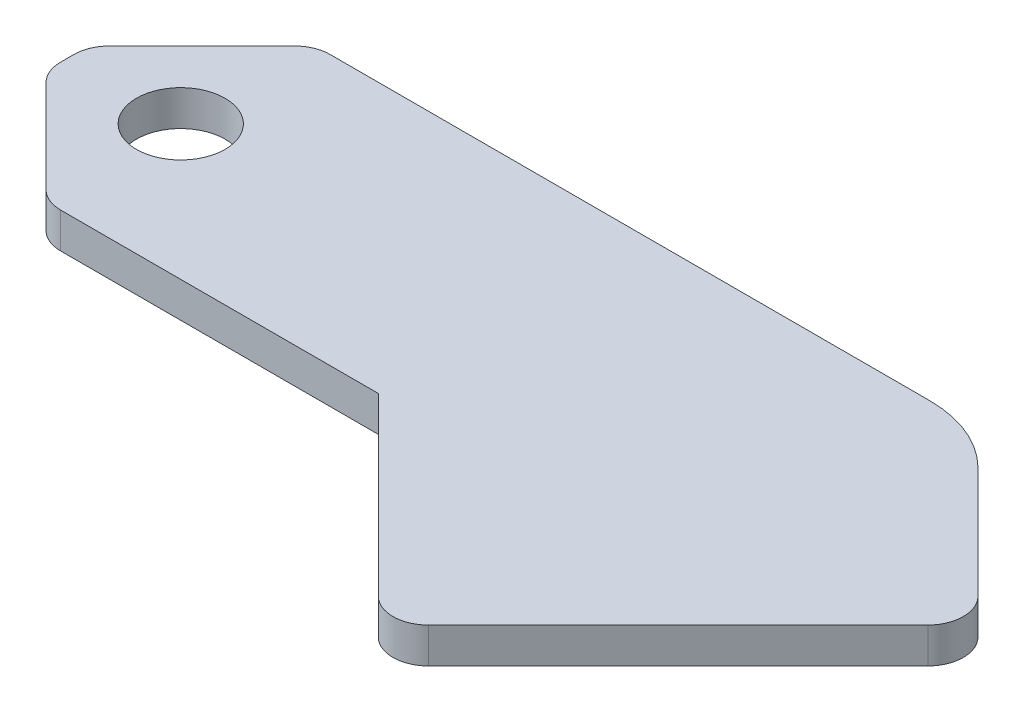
ISO-10303-21;
HEADER;
FILE_DESCRIPTION(('STEP AP214'),'2;1');
FILE_NAME('part.step','',(''),(''),'','','');
FILE_SCHEMA(('AUTOMOTIVE_DESIGN { 1 0 10303 214 1 1 1 1 }'));
ENDSEC;
DATA;
#1=APPLICATION_CONTEXT('core data for automotive mechanical design processes');
#2=APPLICATION_PROTOCOL_DEFINITION('international standard','automotive_design',2000,#1);
#3=PRODUCT_CONTEXT('',#1,'mechanical');
#4=PRODUCT('Part','Part','',(#3));
#5=PRODUCT_RELATED_PRODUCT_CATEGORY('part','',(#4));
#6=PRODUCT_DEFINITION_FORMATION('','',#4);
#7=PRODUCT_DEFINITION_CONTEXT('part definition',#1,'design');
#8=PRODUCT_DEFINITION('design','',#6,#7);
#9=PRODUCT_DEFINITION_SHAPE('','',#8);
#10=(LENGTH_UNIT() NAMED_UNIT(*) SI_UNIT(.MILLI.,.METRE.));
#11=(NAMED_UNIT(*) PLANE_ANGLE_UNIT() SI_UNIT($,.RADIAN.));
#12=(NAMED_UNIT(*) SI_UNIT($,.STERADIAN.) SOLID_ANGLE_UNIT());
#13=UNCERTAINTY_MEASURE_WITH_UNIT(LENGTH_MEASURE(1.E-05),#10,'distance_accuracy_value','');
#14=(GEOMETRIC_REPRESENTATION_CONTEXT(3) GLOBAL_UNCERTAINTY_ASSIGNED_CONTEXT((#13)) GLOBAL_UNIT_ASSIGNED_CONTEXT((#10,
#11,#12)) REPRESENTATION_CONTEXT('',''));
#15=CARTESIAN_POINT('',(0.,0.,0.));
#16=DIRECTION('',(0.,0.,1.));
#17=DIRECTION('',(1.,0.,0.));
#18=AXIS2_PLACEMENT_3D('',#15,#16,#17);
#19=CARTESIAN_POINT('',(-11.,-2.5,0.9289321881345));
#20=DIRECTION('',(0.,1.,0.));
#21=DIRECTION('',(0.,0.,1.));
#22=AXIS2_PLACEMENT_3D('',#19,#20,#21);
#23=CYLINDRICAL_SURFACE('',#22,5.00000000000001);
#24=CARTESIAN_POINT('',(-11.,2.5,0.9289321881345));
#25=DIRECTION('',(0.,1.,0.));
#26=DIRECTION('',(0.,0.,1.));
#27=AXIS2_PLACEMENT_3D('',#24,#25,#26);
#28=CIRCLE('',#27,5.00000000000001);
#29=CARTESIAN_POINT('',(-16.,2.5,0.9289321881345));
#30=VERTEX_POINT('',#29);
#31=CARTESIAN_POINT('',(-14.5355339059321,2.5,4.46446609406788));
#32=VERTEX_POINT('',#31);
#33=EDGE_CURVE('E174',#30,#32,#28,.T.);
#34=ORIENTED_EDGE('',*,*,#33,.F.);
#35=DIRECTION('',(0.,1.,0.));
#36=VECTOR('',#35,1.);
#37=CARTESIAN_POINT('',(-16.,-2.5,0.9289321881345));
#38=LINE('',#37,#36);
#39=CARTESIAN_POINT('',(-16.,-2.5,0.9289321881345));
#40=VERTEX_POINT('',#39);
#41=EDGE_CURVE('E11',#40,#30,#38,.T.);
#42=ORIENTED_EDGE('',*,*,#41,.F.);
#43=CARTESIAN_POINT('',(-11.,-2.5,0.9289321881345));
#44=DIRECTION('',(0.,1.,0.));
#45=DIRECTION('',(0.,0.,1.));
#46=AXIS2_PLACEMENT_3D('',#43,#44,#45);
#47=CIRCLE('',#46,5.00000000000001);
#48=CARTESIAN_POINT('',(-14.5355339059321,-2.5,4.46446609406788));
#49=VERTEX_POINT('',#48);
#50=EDGE_CURVE('E216',#40,#49,#47,.T.);
#51=ORIENTED_EDGE('',*,*,#50,.T.);
#52=DIRECTION('',(0.,1.,0.));
#53=VECTOR('',#52,1.);
#54=CARTESIAN_POINT('',(-14.5355339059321,-2.5,4.46446609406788));
#55=LINE('',#54,#53);
#56=EDGE_CURVE('E38',#49,#32,#55,.T.);
#57=ORIENTED_EDGE('',*,*,#56,.T.);
#58=EDGE_LOOP('',(#34,#42,#51,#57));
#59=FACE_BOUND('',#58,.T.);
#60=ADVANCED_FACE('F35',(#59),#23,.T.);
#61=CARTESIAN_POINT('',(-16.,-2.5,-0.9289321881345));
#62=DIRECTION('',(-1.,0.,0.));
#63=DIRECTION('',(0.,0.,1.));
#64=AXIS2_PLACEMENT_3D('',#61,#62,#63);
#65=PLANE('',#64);
#66=DIRECTION('',(0.,0.,1.));
#67=VECTOR('',#66,1.);
#68=CARTESIAN_POINT('',(-16.,2.5,-0.9289321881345));
#69=LINE('',#68,#67);
#70=CARTESIAN_POINT('',(-16.,2.5,-0.928932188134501));
#71=VERTEX_POINT('',#70);
#72=EDGE_CURVE('E214',#71,#30,#69,.T.);
#73=ORIENTED_EDGE('',*,*,#72,.F.);
#74=DIRECTION('',(0.,1.,0.));
#75=VECTOR('',#74,1.);
#76=CARTESIAN_POINT('',(-16.,-2.5,-0.928932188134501));
#77=LINE('',#76,#75);
#78=CARTESIAN_POINT('',(-16.,-2.5,-0.928932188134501));
#79=VERTEX_POINT('',#78);
#80=EDGE_CURVE('E44',#79,#71,#77,.T.);
#81=ORIENTED_EDGE('',*,*,#80,.F.);
#82=DIRECTION('',(0.,0.,1.));
#83=VECTOR('',#82,1.);
#84=CARTESIAN_POINT('',(-16.,-2.5,-0.9289321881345));
#85=LINE('',#84,#83);
#86=EDGE_CURVE('E164',#79,#40,#85,.T.);
#87=ORIENTED_EDGE('',*,*,#86,.T.);
#88=ORIENTED_EDGE('',*,*,#41,.T.);
#89=EDGE_LOOP('',(#73,#81,#87,#88));
#90=FACE_BOUND('',#89,.T.);
#91=ADVANCED_FACE('F242',(#90),#65,.T.);
#92=CARTESIAN_POINT('',(-11.,-2.5,-0.9289321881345));
#93=DIRECTION('',(0.,1.,0.));
#94=DIRECTION('',(0.,0.,1.));
#95=AXIS2_PLACEMENT_3D('',#92,#93,#94);
#96=CYLINDRICAL_SURFACE('',#95,5.00000000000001);
#97=CARTESIAN_POINT('',(-11.,2.5,-0.9289321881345));
#98=DIRECTION('',(0.,1.,0.));
#99=DIRECTION('',(0.,0.,1.));
#100=AXIS2_PLACEMENT_3D('',#97,#98,#99);
#101=CIRCLE('',#100,5.00000000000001);
#102=CARTESIAN_POINT('',(-14.5355339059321,2.5,-4.46446609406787));
#103=VERTEX_POINT('',#102);
#104=EDGE_CURVE('E151',#103,#71,#101,.T.);
#105=ORIENTED_EDGE('',*,*,#104,.F.);
#106=DIRECTION('',(0.,1.,0.));
#107=VECTOR('',#106,1.);
#108=CARTESIAN_POINT('',(-14.5355339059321,-2.5,-4.46446609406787));
#109=LINE('',#108,#107);
#110=CARTESIAN_POINT('',(-14.5355339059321,-2.5,-4.46446609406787));
#111=VERTEX_POINT('',#110);
#112=EDGE_CURVE('E146',#111,#103,#109,.T.);
#113=ORIENTED_EDGE('',*,*,#112,.F.);
#114=CARTESIAN_POINT('',(-11.,-2.5,-0.9289321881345));
#115=DIRECTION('',(0.,1.,0.));
#116=DIRECTION('',(0.,0.,1.));
#117=AXIS2_PLACEMENT_3D('',#114,#115,#116);
#118=CIRCLE('',#117,5.00000000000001);
#119=EDGE_CURVE('E149',#111,#79,#118,.T.);
#120=ORIENTED_EDGE('',*,*,#119,.T.);
#121=ORIENTED_EDGE('',*,*,#80,.T.);
#122=EDGE_LOOP('',(#105,#113,#120,#121));
#123=FACE_BOUND('',#122,.T.);
#124=ADVANCED_FACE('F148',(#123),#96,.T.);
#125=CARTESIAN_POINT('',(-1.464466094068,-2.5,-17.535533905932));
#126=DIRECTION('',(-0.707106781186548,0.,-0.707106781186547));
#127=DIRECTION('',(-0.707106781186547,0.,0.707106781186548));
#128=AXIS2_PLACEMENT_3D('',#125,#126,#127);
#129=PLANE('',#128);
#130=DIRECTION('',(-0.707106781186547,0.,0.707106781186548));
#131=VECTOR('',#130,1.);
#132=CARTESIAN_POINT('',(-1.464466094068,2.5,-17.535533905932));
#133=LINE('',#132,#131);
#134=CARTESIAN_POINT('',(-1.46446609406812,2.5,-17.5355339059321));
#135=VERTEX_POINT('',#134);
#136=EDGE_CURVE('E211',#135,#103,#133,.T.);
#137=ORIENTED_EDGE('',*,*,#136,.F.);
#138=DIRECTION('',(0.,1.,0.));
#139=VECTOR('',#138,1.);
#140=CARTESIAN_POINT('',(-1.46446609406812,-2.5,-17.5355339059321));
#141=LINE('',#140,#139);
#142=CARTESIAN_POINT('',(-1.46446609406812,-2.5,-17.5355339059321));
#143=VERTEX_POINT('',#142);
#144=EDGE_CURVE('E156',#143,#135,#141,.T.);
#145=ORIENTED_EDGE('',*,*,#144,.F.);
#146=DIRECTION('',(-0.707106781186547,0.,0.707106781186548));
#147=VECTOR('',#146,1.);
#148=CARTESIAN_POINT('',(-1.464466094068,-2.5,-17.535533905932));
#149=LINE('',#148,#147);
#150=EDGE_CURVE('E162',#143,#111,#149,.T.);
#151=ORIENTED_EDGE('',*,*,#150,.T.);
#152=ORIENTED_EDGE('',*,*,#112,.T.);
#153=EDGE_LOOP('',(#137,#145,#151,#152));
#154=FACE_BOUND('',#153,.T.);
#155=ADVANCED_FACE('F166',(#154),#129,.T.);
#156=CARTESIAN_POINT('',(2.071067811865,-2.5,-14.));
#157=DIRECTION('',(0.,1.,0.));
#158=DIRECTION('',(0.,0.,1.));
#159=AXIS2_PLACEMENT_3D('',#156,#157,#158);
#160=CYLINDRICAL_SURFACE('',#159,4.99999999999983);
#161=CARTESIAN_POINT('',(2.071067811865,2.5,-14.));
#162=DIRECTION('',(0.,1.,0.));
#163=DIRECTION('',(0.,0.,1.));
#164=AXIS2_PLACEMENT_3D('',#161,#162,#163);
#165=CIRCLE('',#164,4.99999999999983);
#166=CARTESIAN_POINT('',(2.071067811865,2.5,-19.));
#167=VERTEX_POINT('',#166);
#168=EDGE_CURVE('E208',#167,#135,#165,.T.);
#169=ORIENTED_EDGE('',*,*,#168,.F.);
#170=DIRECTION('',(0.,1.,0.));
#171=VECTOR('',#170,1.);
#172=CARTESIAN_POINT('',(2.071067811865,-2.5,-19.));
#173=LINE('',#172,#171);
#174=CARTESIAN_POINT('',(2.071067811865,-2.5,-19.));
#175=VERTEX_POINT('',#174);
#176=EDGE_CURVE('E220',#175,#167,#173,.T.);
#177=ORIENTED_EDGE('',*,*,#176,.F.);
#178=CARTESIAN_POINT('',(2.071067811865,-2.5,-14.));
#179=DIRECTION('',(0.,1.,0.));
#180=DIRECTION('',(0.,0.,1.));
#181=AXIS2_PLACEMENT_3D('',#178,#179,#180);
#182=CIRCLE('',#181,4.99999999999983);
#183=EDGE_CURVE('E167',#175,#143,#182,.T.);
#184=ORIENTED_EDGE('',*,*,#183,.T.);
#185=ORIENTED_EDGE('',*,*,#144,.T.);
#186=EDGE_LOOP('',(#169,#177,#184,#185));
#187=FACE_BOUND('',#186,.T.);
#188=ADVANCED_FACE('F255',(#187),#160,.T.);
#189=CARTESIAN_POINT('',(86.64625089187,-2.5,-19.));
#190=DIRECTION('',(0.,0.,-1.));
#191=DIRECTION('',(-1.,0.,0.));
#192=AXIS2_PLACEMENT_3D('',#189,#190,#191);
#193=PLANE('',#192);
#194=DIRECTION('',(-1.,0.,0.));
#195=VECTOR('',#194,1.);
#196=CARTESIAN_POINT('',(86.64625089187,2.5,-19.));
#197=LINE('',#196,#195);
#198=CARTESIAN_POINT('',(86.64625089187,2.5,-19.));
#199=VERTEX_POINT('',#198);
#200=EDGE_CURVE('E205',#199,#167,#197,.T.);
#201=ORIENTED_EDGE('',*,*,#200,.F.);
#202=DIRECTION('',(0.,1.,0.));
#203=VECTOR('',#202,1.);
#204=CARTESIAN_POINT('',(86.64625089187,-2.5,-19.));
#205=LINE('',#204,#203);
#206=CARTESIAN_POINT('',(86.64625089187,-2.5,-19.));
#207=VERTEX_POINT('',#206);
#208=EDGE_CURVE('E222',#207,#199,#205,.T.);
#209=ORIENTED_EDGE('',*,*,#208,.F.);
#210=DIRECTION('',(-1.,0.,0.));
#211=VECTOR('',#210,1.);
#212=CARTESIAN_POINT('',(86.64625089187,-2.5,-19.));
#213=LINE('',#212,#211);
#214=EDGE_CURVE('E169',#207,#175,#213,.T.);
#215=ORIENTED_EDGE('',*,*,#214,.T.);
#216=ORIENTED_EDGE('',*,*,#176,.T.);
#217=EDGE_LOOP('',(#201,#209,#215,#216));
#218=FACE_BOUND('',#217,.T.);
#219=ADVANCED_FACE('F258',(#218),#193,.T.);
#220=CARTESIAN_POINT('',(86.64625089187,-2.5,-2.64));
#221=DIRECTION('',(0.,1.,0.));
#222=DIRECTION('',(0.,0.,1.));
#223=AXIS2_PLACEMENT_3D('',#220,#221,#222);
#224=CYLINDRICAL_SURFACE('',#223,16.36);
#225=CARTESIAN_POINT('',(86.64625089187,2.5,-2.64));
#226=DIRECTION('',(0.,1.,0.));
#227=DIRECTION('',(0.,0.,1.));
#228=AXIS2_PLACEMENT_3D('',#225,#226,#227);
#229=CIRCLE('',#228,16.36);
#230=CARTESIAN_POINT('',(98.214517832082,2.5,-14.208266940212));
#231=VERTEX_POINT('',#230);
#232=EDGE_CURVE('E202',#231,#199,#229,.T.);
#233=ORIENTED_EDGE('',*,*,#232,.F.);
#234=DIRECTION('',(0.,1.,0.));
#235=VECTOR('',#234,1.);
#236=CARTESIAN_POINT('',(98.214517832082,-2.5,-14.208266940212));
#237=LINE('',#236,#235);
#238=CARTESIAN_POINT('',(98.214517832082,-2.5,-14.208266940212));
#239=VERTEX_POINT('',#238);
#240=EDGE_CURVE('E224',#239,#231,#237,.T.);
#241=ORIENTED_EDGE('',*,*,#240,.F.);
#242=CARTESIAN_POINT('',(86.64625089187,-2.5,-2.64));
#243=DIRECTION('',(0.,1.,0.));
#244=DIRECTION('',(0.,0.,1.));
#245=AXIS2_PLACEMENT_3D('',#242,#243,#244);
#246=CIRCLE('',#245,16.36);
#247=EDGE_CURVE('E342',#239,#207,#246,.T.);
#248=ORIENTED_EDGE('',*,*,#247,.T.);
#249=ORIENTED_EDGE('',*,*,#208,.T.);
#250=EDGE_LOOP('',(#233,#241,#248,#249));
#251=FACE_BOUND('',#250,.T.);
#252=ADVANCED_FACE('F262',(#251),#224,.T.);
#253=CARTESIAN_POINT('',(113.886536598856,-2.5,1.46375182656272));
#254=DIRECTION('',(0.707106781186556,0.,-0.707106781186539));
#255=DIRECTION('',(-0.707106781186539,0.,-0.707106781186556));
#256=AXIS2_PLACEMENT_3D('',#253,#254,#255);
#257=PLANE('',#256);
#258=DIRECTION('',(-0.707106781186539,0.,-0.707106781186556));
#259=VECTOR('',#258,1.);
#260=CARTESIAN_POINT('',(113.886536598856,2.5,1.46375182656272));
#261=LINE('',#260,#259);
#262=CARTESIAN_POINT('',(113.886536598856,2.5,1.46375182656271));
#263=VERTEX_POINT('',#262);
#264=EDGE_CURVE('E199',#263,#231,#261,.T.);
#265=ORIENTED_EDGE('',*,*,#264,.F.);
#266=DIRECTION('',(0.,1.,0.));
#267=VECTOR('',#266,1.);
#268=CARTESIAN_POINT('',(113.886536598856,-2.5,1.46375182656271));
#269=LINE('',#268,#267);
#270=CARTESIAN_POINT('',(113.886536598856,-2.5,1.46375182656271));
#271=VERTEX_POINT('',#270);
#272=EDGE_CURVE('E226',#271,#263,#269,.T.);
#273=ORIENTED_EDGE('',*,*,#272,.F.);
#274=DIRECTION('',(-0.707106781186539,0.,-0.707106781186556));
#275=VECTOR('',#274,1.);
#276=CARTESIAN_POINT('',(113.886536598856,-2.5,1.46375182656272));
#277=LINE('',#276,#275);
#278=EDGE_CURVE('E339',#271,#239,#277,.T.);
#279=ORIENTED_EDGE('',*,*,#278,.T.);
#280=ORIENTED_EDGE('',*,*,#240,.T.);
#281=EDGE_LOOP('',(#265,#273,#279,#280));
#282=FACE_BOUND('',#281,.T.);
#283=ADVANCED_FACE('F266',(#282),#257,.T.);
#284=CARTESIAN_POINT('',(110.35100269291,-2.5,4.9992857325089));
#285=DIRECTION('',(0.,1.,0.));
#286=DIRECTION('',(0.,0.,1.));
#287=AXIS2_PLACEMENT_3D('',#284,#285,#286);
#288=CYLINDRICAL_SURFACE('',#287,5.00000000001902);
#289=CARTESIAN_POINT('',(110.35100269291,2.5,4.9992857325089));
#290=DIRECTION('',(0.,1.,0.));
#291=DIRECTION('',(0.,0.,1.));
#292=AXIS2_PLACEMENT_3D('',#289,#290,#291);
#293=CIRCLE('',#292,5.00000000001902);
#294=CARTESIAN_POINT('',(113.886536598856,2.5,8.5348196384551));
#295=VERTEX_POINT('',#294);
#296=EDGE_CURVE('E196',#295,#263,#293,.T.);
#297=ORIENTED_EDGE('',*,*,#296,.F.);
#298=DIRECTION('',(0.,1.,0.));
#299=VECTOR('',#298,1.);
#300=CARTESIAN_POINT('',(113.886536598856,-2.5,8.5348196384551));
#301=LINE('',#300,#299);
#302=CARTESIAN_POINT('',(113.886536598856,-2.5,8.5348196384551));
#303=VERTEX_POINT('',#302);
#304=EDGE_CURVE('E228',#303,#295,#301,.T.);
#305=ORIENTED_EDGE('',*,*,#304,.F.);
#306=CARTESIAN_POINT('',(110.35100269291,-2.5,4.9992857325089));
#307=DIRECTION('',(0.,1.,0.));
#308=DIRECTION('',(0.,0.,1.));
#309=AXIS2_PLACEMENT_3D('',#306,#307,#308);
#310=CIRCLE('',#309,5.00000000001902);
#311=EDGE_CURVE('E336',#303,#271,#310,.T.);
#312=ORIENTED_EDGE('',*,*,#311,.T.);
#313=ORIENTED_EDGE('',*,*,#272,.T.);
#314=EDGE_LOOP('',(#297,#305,#312,#313));
#315=FACE_BOUND('',#314,.T.);
#316=ADVANCED_FACE('F270',(#315),#288,.T.);
#317=CARTESIAN_POINT('',(78.6726188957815,-2.5,43.7487373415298));
#318=DIRECTION('',(0.707106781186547,0.,0.707106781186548));
#319=DIRECTION('',(0.707106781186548,0.,-0.707106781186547));
#320=AXIS2_PLACEMENT_3D('',#317,#318,#319);
#321=PLANE('',#320);
#322=DIRECTION('',(0.707106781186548,0.,-0.707106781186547));
#323=VECTOR('',#322,1.);
#324=CARTESIAN_POINT('',(78.6726188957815,2.5,43.7487373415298));
#325=LINE('',#324,#323);
#326=CARTESIAN_POINT('',(78.6726188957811,2.5,43.7487373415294));
#327=VERTEX_POINT('',#326);
#328=EDGE_CURVE('E193',#327,#295,#325,.T.);
#329=ORIENTED_EDGE('',*,*,#328,.F.);
#330=DIRECTION('',(0.,1.,0.));
#331=VECTOR('',#330,1.);
#332=CARTESIAN_POINT('',(78.6726188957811,-2.5,43.7487373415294));
#333=LINE('',#332,#331);
#334=CARTESIAN_POINT('',(78.6726188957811,-2.5,43.7487373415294));
#335=VERTEX_POINT('',#334);
#336=EDGE_CURVE('E230',#335,#327,#333,.T.);
#337=ORIENTED_EDGE('',*,*,#336,.F.);
#338=DIRECTION('',(0.707106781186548,0.,-0.707106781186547));
#339=VECTOR('',#338,1.);
#340=CARTESIAN_POINT('',(78.6726188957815,-2.5,43.7487373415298));
#341=LINE('',#340,#339);
#342=EDGE_CURVE('E333',#335,#303,#341,.T.);
#343=ORIENTED_EDGE('',*,*,#342,.T.);
#344=ORIENTED_EDGE('',*,*,#304,.T.);
#345=EDGE_LOOP('',(#329,#337,#343,#344));
#346=FACE_BOUND('',#345,.T.);
#347=ADVANCED_FACE('F274',(#346),#321,.T.);
#348=CARTESIAN_POINT('',(75.13708498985,-2.5,40.2132034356));
#349=DIRECTION('',(0.,1.,0.));
#350=DIRECTION('',(0.,0.,1.));
#351=AXIS2_PLACEMENT_3D('',#348,#349,#350);
#352=CYLINDRICAL_SURFACE('',#351,4.9999999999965);
#353=CARTESIAN_POINT('',(75.13708498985,2.5,40.2132034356));
#354=DIRECTION('',(0.,1.,0.));
#355=DIRECTION('',(0.,0.,1.));
#356=AXIS2_PLACEMENT_3D('',#353,#354,#355);
#357=CIRCLE('',#356,4.9999999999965);
#358=CARTESIAN_POINT('',(71.6015510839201,2.5,43.7487373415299));
#359=VERTEX_POINT('',#358);
#360=EDGE_CURVE('E190',#359,#327,#357,.T.);
#361=ORIENTED_EDGE('',*,*,#360,.F.);
#362=DIRECTION('',(0.,1.,0.));
#363=VECTOR('',#362,1.);
#364=CARTESIAN_POINT('',(71.6015510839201,-2.5,43.7487373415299));
#365=LINE('',#364,#363);
#366=CARTESIAN_POINT('',(71.6015510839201,-2.5,43.7487373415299));
#367=VERTEX_POINT('',#366);
#368=EDGE_CURVE('E232',#367,#359,#365,.T.);
#369=ORIENTED_EDGE('',*,*,#368,.F.);
#370=CARTESIAN_POINT('',(75.13708498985,-2.5,40.2132034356));
#371=DIRECTION('',(0.,1.,0.));
#372=DIRECTION('',(0.,0.,1.));
#373=AXIS2_PLACEMENT_3D('',#370,#371,#372);
#374=CIRCLE('',#373,4.9999999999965);
#375=EDGE_CURVE('E330',#367,#335,#374,.T.);
#376=ORIENTED_EDGE('',*,*,#375,.T.);
#377=ORIENTED_EDGE('',*,*,#336,.T.);
#378=EDGE_LOOP('',(#361,#369,#376,#377));
#379=FACE_BOUND('',#378,.T.);
#380=ADVANCED_FACE('F278',(#379),#352,.T.);
#381=CARTESIAN_POINT('',(46.85281374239,-2.5,19.));
#382=DIRECTION('',(-0.707106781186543,0.,0.707106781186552));
#383=DIRECTION('',(0.707106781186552,0.,0.707106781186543));
#384=AXIS2_PLACEMENT_3D('',#381,#382,#383);
#385=PLANE('',#384);
#386=DIRECTION('',(0.707106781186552,0.,0.707106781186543));
#387=VECTOR('',#386,1.);
#388=CARTESIAN_POINT('',(46.85281374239,2.5,19.));
#389=LINE('',#388,#387);
#390=CARTESIAN_POINT('',(46.85281374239,2.5,19.));
#391=VERTEX_POINT('',#390);
#392=EDGE_CURVE('E187',#391,#359,#389,.T.);
#393=ORIENTED_EDGE('',*,*,#392,.F.);
#394=DIRECTION('',(0.,1.,0.));
#395=VECTOR('',#394,1.);
#396=CARTESIAN_POINT('',(46.85281374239,-2.5,19.));
#397=LINE('',#396,#395);
#398=CARTESIAN_POINT('',(46.85281374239,-2.5,19.));
#399=VERTEX_POINT('',#398);
#400=EDGE_CURVE('E234',#399,#391,#397,.T.);
#401=ORIENTED_EDGE('',*,*,#400,.F.);
#402=DIRECTION('',(0.707106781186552,0.,0.707106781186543));
#403=VECTOR('',#402,1.);
#404=CARTESIAN_POINT('',(46.85281374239,-2.5,19.));
#405=LINE('',#404,#403);
#406=EDGE_CURVE('E327',#399,#367,#405,.T.);
#407=ORIENTED_EDGE('',*,*,#406,.T.);
#408=ORIENTED_EDGE('',*,*,#368,.T.);
#409=EDGE_LOOP('',(#393,#401,#407,#408));
#410=FACE_BOUND('',#409,.T.);
#411=ADVANCED_FACE('F282',(#410),#385,.T.);
#412=CARTESIAN_POINT('',(2.071067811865,-2.5,19.));
#413=DIRECTION('',(0.,0.,1.));
#414=DIRECTION('',(1.,0.,0.));
#415=AXIS2_PLACEMENT_3D('',#412,#413,#414);
#416=PLANE('',#415);
#417=DIRECTION('',(1.,0.,0.));
#418=VECTOR('',#417,1.);
#419=CARTESIAN_POINT('',(2.071067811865,2.5,19.));
#420=LINE('',#419,#418);
#421=CARTESIAN_POINT('',(2.071067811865,2.5,18.9999999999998));
#422=VERTEX_POINT('',#421);
#423=EDGE_CURVE('E184',#422,#391,#420,.T.);
#424=ORIENTED_EDGE('',*,*,#423,.F.);
#425=DIRECTION('',(0.,1.,0.));
#426=VECTOR('',#425,1.);
#427=CARTESIAN_POINT('',(2.071067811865,-2.5,18.9999999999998));
#428=LINE('',#427,#426);
#429=CARTESIAN_POINT('',(2.071067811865,-2.5,18.9999999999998));
#430=VERTEX_POINT('',#429);
#431=EDGE_CURVE('E236',#430,#422,#428,.T.);
#432=ORIENTED_EDGE('',*,*,#431,.F.);
#433=DIRECTION('',(1.,0.,0.));
#434=VECTOR('',#433,1.);
#435=CARTESIAN_POINT('',(2.071067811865,-2.5,19.));
#436=LINE('',#435,#434);
#437=EDGE_CURVE('E324',#430,#399,#436,.T.);
#438=ORIENTED_EDGE('',*,*,#437,.T.);
#439=ORIENTED_EDGE('',*,*,#400,.T.);
#440=EDGE_LOOP('',(#424,#432,#438,#439));
#441=FACE_BOUND('',#440,.T.);
#442=ADVANCED_FACE('F286',(#441),#416,.T.);
#443=CARTESIAN_POINT('',(2.071067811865,-2.5,14.));
#444=DIRECTION('',(0.,1.,0.));
#445=DIRECTION('',(0.,0.,1.));
#446=AXIS2_PLACEMENT_3D('',#443,#444,#445);
#447=CYLINDRICAL_SURFACE('',#446,4.99999999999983);
#448=CARTESIAN_POINT('',(2.071067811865,2.5,14.));
#449=DIRECTION('',(0.,1.,0.));
#450=DIRECTION('',(0.,0.,1.));
#451=AXIS2_PLACEMENT_3D('',#448,#449,#450);
#452=CIRCLE('',#451,4.99999999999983);
#453=CARTESIAN_POINT('',(-1.464466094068,2.5,17.535533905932));
#454=VERTEX_POINT('',#453);
#455=EDGE_CURVE('E181',#454,#422,#452,.T.);
#456=ORIENTED_EDGE('',*,*,#455,.F.);
#457=DIRECTION('',(0.,1.,0.));
#458=VECTOR('',#457,1.);
#459=CARTESIAN_POINT('',(-1.464466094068,-2.5,17.535533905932));
#460=LINE('',#459,#458);
#461=CARTESIAN_POINT('',(-1.464466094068,-2.5,17.535533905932));
#462=VERTEX_POINT('',#461);
#463=EDGE_CURVE('E237',#462,#454,#460,.T.);
#464=ORIENTED_EDGE('',*,*,#463,.F.);
#465=CARTESIAN_POINT('',(2.071067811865,-2.5,14.));
#466=DIRECTION('',(0.,1.,0.));
#467=DIRECTION('',(0.,0.,1.));
#468=AXIS2_PLACEMENT_3D('',#465,#466,#467);
#469=CIRCLE('',#468,4.99999999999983);
#470=EDGE_CURVE('E321',#462,#430,#469,.T.);
#471=ORIENTED_EDGE('',*,*,#470,.T.);
#472=ORIENTED_EDGE('',*,*,#431,.T.);
#473=EDGE_LOOP('',(#456,#464,#471,#472));
#474=FACE_BOUND('',#473,.T.);
#475=ADVANCED_FACE('F290',(#474),#447,.T.);
#476=CARTESIAN_POINT('',(-14.5355339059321,-2.5,4.46446609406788));
#477=DIRECTION('',(-0.707106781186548,0.,0.707106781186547));
#478=DIRECTION('',(0.707106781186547,0.,0.707106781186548));
#479=AXIS2_PLACEMENT_3D('',#476,#477,#478);
#480=PLANE('',#479);
#481=DIRECTION('',(0.707106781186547,0.,0.707106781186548));
#482=VECTOR('',#481,1.);
#483=CARTESIAN_POINT('',(-14.5355339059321,2.5,4.46446609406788));
#484=LINE('',#483,#482);
#485=EDGE_CURVE('E177',#32,#454,#484,.T.);
#486=ORIENTED_EDGE('',*,*,#485,.F.);
#487=ORIENTED_EDGE('',*,*,#56,.F.);
#488=DIRECTION('',(0.707106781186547,0.,0.707106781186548));
#489=VECTOR('',#488,1.);
#490=CARTESIAN_POINT('',(-14.5355339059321,-2.5,4.46446609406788));
#491=LINE('',#490,#489);
#492=EDGE_CURVE('E319',#49,#462,#491,.T.);
#493=ORIENTED_EDGE('',*,*,#492,.T.);
#494=ORIENTED_EDGE('',*,*,#463,.T.);
#495=EDGE_LOOP('',(#486,#487,#493,#494));
#496=FACE_BOUND('',#495,.T.);
#497=ADVANCED_FACE('F239',(#496),#480,.T.);
#498=CARTESIAN_POINT('',(-11.,-2.5,0.9289321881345));
#499=DIRECTION('',(0.,1.,0.));
#500=DIRECTION('',(0.,0.,1.));
#501=AXIS2_PLACEMENT_3D('',#498,#499,#500);
#502=PLANE('',#501);
#503=CARTESIAN_POINT('',(0.,-2.5,0.));
#504=DIRECTION('',(0.,1.,0.));
#505=DIRECTION('',(0.,0.,-1.));
#506=AXIS2_PLACEMENT_3D('',#503,#504,#505);
#507=CIRCLE('',#506,6.25);
#508=CARTESIAN_POINT('',(0.,-2.5,-6.25));
#509=VERTEX_POINT('',#508);
#510=EDGE_CURVE('E178',#509,#509,#507,.T.);
#511=ORIENTED_EDGE('',*,*,#510,.T.);
#512=EDGE_LOOP('',(#511));
#513=FACE_BOUND('',#512,.T.);
#514=ORIENTED_EDGE('',*,*,#50,.F.);
#515=ORIENTED_EDGE('',*,*,#86,.F.);
#516=ORIENTED_EDGE('',*,*,#119,.F.);
#517=ORIENTED_EDGE('',*,*,#150,.F.);
#518=ORIENTED_EDGE('',*,*,#183,.F.);
#519=ORIENTED_EDGE('',*,*,#214,.F.);
#520=ORIENTED_EDGE('',*,*,#247,.F.);
#521=ORIENTED_EDGE('',*,*,#278,.F.);
#522=ORIENTED_EDGE('',*,*,#311,.F.);
#523=ORIENTED_EDGE('',*,*,#342,.F.);
#524=ORIENTED_EDGE('',*,*,#375,.F.);
#525=ORIENTED_EDGE('',*,*,#406,.F.);
#526=ORIENTED_EDGE('',*,*,#437,.F.);
#527=ORIENTED_EDGE('',*,*,#470,.F.);
#528=ORIENTED_EDGE('',*,*,#492,.F.);
#529=EDGE_LOOP('',(#514,#515,#516,#517,#518,#519,#520,#521,#522,#523,#524,#525,#526,#527,#528));
#530=FACE_BOUND('',#529,.T.);
#531=ADVANCED_FACE('F160',(#513,#530),#502,.F.);
#532=CARTESIAN_POINT('',(-11.,2.5,0.9289321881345));
#533=DIRECTION('',(0.,1.,0.));
#534=DIRECTION('',(0.,0.,1.));
#535=AXIS2_PLACEMENT_3D('',#532,#533,#534);
#536=PLANE('',#535);
#537=CARTESIAN_POINT('',(0.,2.5,0.));
#538=DIRECTION('',(0.,1.,0.));
#539=DIRECTION('',(0.,0.,-1.));
#540=AXIS2_PLACEMENT_3D('',#537,#538,#539);
#541=CIRCLE('',#540,6.25);
#542=CARTESIAN_POINT('',(0.,2.5,-6.25));
#543=VERTEX_POINT('',#542);
#544=EDGE_CURVE('E314',#543,#543,#541,.T.);
#545=ORIENTED_EDGE('',*,*,#544,.F.);
#546=EDGE_LOOP('',(#545));
#547=FACE_BOUND('',#546,.T.);
#548=ORIENTED_EDGE('',*,*,#33,.T.);
#549=ORIENTED_EDGE('',*,*,#485,.T.);
#550=ORIENTED_EDGE('',*,*,#455,.T.);
#551=ORIENTED_EDGE('',*,*,#423,.T.);
#552=ORIENTED_EDGE('',*,*,#392,.T.);
#553=ORIENTED_EDGE('',*,*,#360,.T.);
#554=ORIENTED_EDGE('',*,*,#328,.T.);
#555=ORIENTED_EDGE('',*,*,#296,.T.);
#556=ORIENTED_EDGE('',*,*,#264,.T.);
#557=ORIENTED_EDGE('',*,*,#232,.T.);
#558=ORIENTED_EDGE('',*,*,#200,.T.);
#559=ORIENTED_EDGE('',*,*,#168,.T.);
#560=ORIENTED_EDGE('',*,*,#136,.T.);
#561=ORIENTED_EDGE('',*,*,#104,.T.);
#562=ORIENTED_EDGE('',*,*,#72,.T.);
#563=EDGE_LOOP('',(#548,#549,#550,#551,#552,#553,#554,#555,#556,#557,#558,#559,#560,#561,#562));
#564=FACE_BOUND('',#563,.T.);
#565=ADVANCED_FACE('F241',(#547,#564),#536,.T.);
#566=CARTESIAN_POINT('',(0.,-2.5,0.));
#567=DIRECTION('',(0.,1.,0.));
#568=DIRECTION('',(0.,0.,1.));
#569=AXIS2_PLACEMENT_3D('',#566,#567,#568);
#570=CYLINDRICAL_SURFACE('',#569,6.25);
#571=ORIENTED_EDGE('',*,*,#510,.F.);
#572=EDGE_LOOP('',(#571));
#573=FACE_BOUND('',#572,.T.);
#574=ORIENTED_EDGE('',*,*,#544,.T.);
#575=EDGE_LOOP('',(#574));
#576=FACE_BOUND('',#575,.T.);
#577=ADVANCED_FACE('F302',(#573,#576),#570,.F.);
#578=CLOSED_SHELL('',(#60,#91,#124,#155,#188,#219,#252,#283,#316,#347,#380,#411,#442,#475,#497,
#531,#565,#577));
#579=MANIFOLD_SOLID_BREP('B2',#578);
#580=ADVANCED_BREP_SHAPE_REPRESENTATION('',(#18,#579),#14);
#581=SHAPE_DEFINITION_REPRESENTATION(#9,#580);
ENDSEC;
END-ISO-10303-21;
